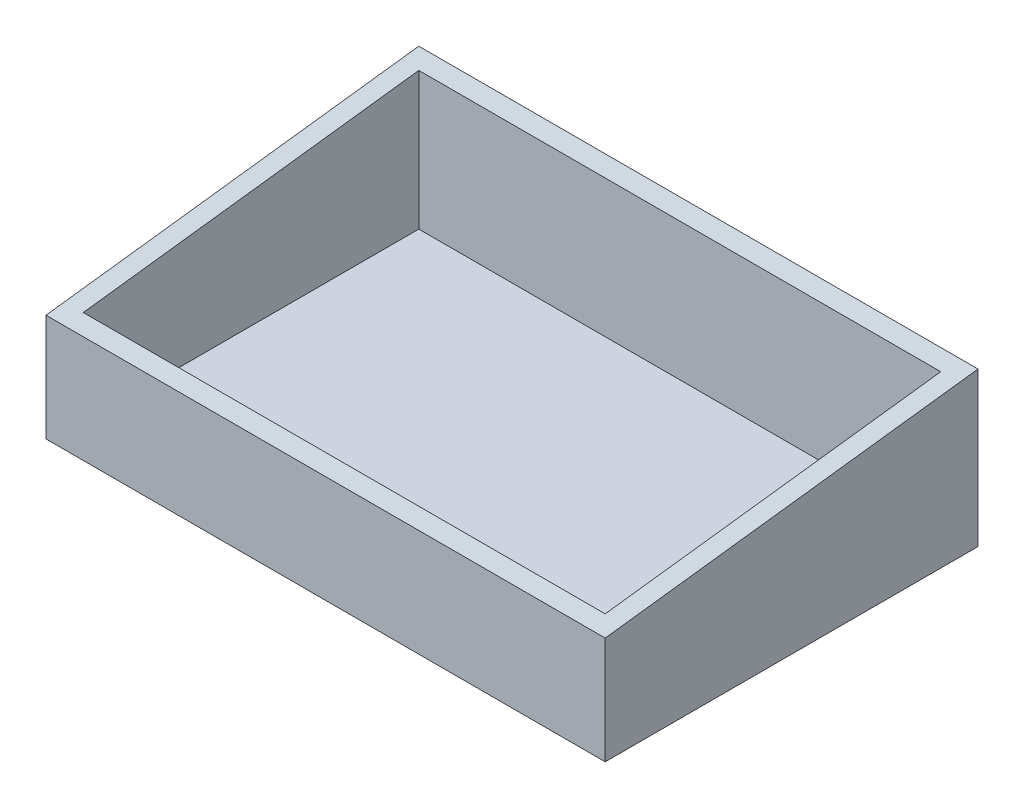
ISO-10303-21;
HEADER;
FILE_DESCRIPTION(('STEP AP214'),'2;1');
FILE_NAME('part.step','',(''),(''),'','','');
FILE_SCHEMA(('AUTOMOTIVE_DESIGN { 1 0 10303 214 1 1 1 1 }'));
ENDSEC;
DATA;
#1=APPLICATION_CONTEXT('core data for automotive mechanical design processes');
#2=APPLICATION_PROTOCOL_DEFINITION('international standard','automotive_design',2000,#1);
#3=PRODUCT_CONTEXT('',#1,'mechanical');
#4=PRODUCT('Part','Part','',(#3));
#5=PRODUCT_RELATED_PRODUCT_CATEGORY('part','',(#4));
#6=PRODUCT_DEFINITION_FORMATION('','',#4);
#7=PRODUCT_DEFINITION_CONTEXT('part definition',#1,'design');
#8=PRODUCT_DEFINITION('design','',#6,#7);
#9=PRODUCT_DEFINITION_SHAPE('','',#8);
#10=(LENGTH_UNIT() NAMED_UNIT(*) SI_UNIT(.MILLI.,.METRE.));
#11=(NAMED_UNIT(*) PLANE_ANGLE_UNIT() SI_UNIT($,.RADIAN.));
#12=(NAMED_UNIT(*) SI_UNIT($,.STERADIAN.) SOLID_ANGLE_UNIT());
#13=UNCERTAINTY_MEASURE_WITH_UNIT(LENGTH_MEASURE(1.E-05),#10,'distance_accuracy_value','');
#14=(GEOMETRIC_REPRESENTATION_CONTEXT(3) GLOBAL_UNCERTAINTY_ASSIGNED_CONTEXT((#13)) GLOBAL_UNIT_ASSIGNED_CONTEXT((#10,
#11,#12)) REPRESENTATION_CONTEXT('',''));
#15=CARTESIAN_POINT('',(0.,0.,0.));
#16=DIRECTION('',(0.,0.,1.));
#17=DIRECTION('',(1.,0.,0.));
#18=AXIS2_PLACEMENT_3D('',#15,#16,#17);
#19=CARTESIAN_POINT('',(-600.,0.,400.));
#20=DIRECTION('',(0.,0.,1.));
#21=DIRECTION('',(1.,0.,0.));
#22=AXIS2_PLACEMENT_3D('',#19,#20,#21);
#23=PLANE('',#22);
#24=DIRECTION('',(0.,-1.,0.));
#25=VECTOR('',#24,1.);
#26=CARTESIAN_POINT('',(0.,0.,400.));
#27=LINE('',#26,#25);
#28=CARTESIAN_POINT('',(0.,115.,400.));
#29=VERTEX_POINT('',#28);
#30=CARTESIAN_POINT('',(0.,0.,400.));
#31=VERTEX_POINT('',#30);
#32=EDGE_CURVE('E142',#29,#31,#27,.T.);
#33=ORIENTED_EDGE('',*,*,#32,.F.);
#34=DIRECTION('',(1.,0.,0.));
#35=VECTOR('',#34,1.);
#36=CARTESIAN_POINT('',(-2274.68322278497,115.,400.));
#37=LINE('',#36,#35);
#38=CARTESIAN_POINT('',(-600.,115.,400.));
#39=VERTEX_POINT('',#38);
#40=EDGE_CURVE('E54',#39,#29,#37,.T.);
#41=ORIENTED_EDGE('',*,*,#40,.F.);
#42=DIRECTION('',(0.,-1.,0.));
#43=VECTOR('',#42,1.);
#44=CARTESIAN_POINT('',(-600.,0.,400.));
#45=LINE('',#44,#43);
#46=CARTESIAN_POINT('',(-600.,0.,400.));
#47=VERTEX_POINT('',#46);
#48=EDGE_CURVE('E133',#39,#47,#45,.T.);
#49=ORIENTED_EDGE('',*,*,#48,.T.);
#50=DIRECTION('',(1.,0.,0.));
#51=VECTOR('',#50,1.);
#52=CARTESIAN_POINT('',(-600.,0.,400.));
#53=LINE('',#52,#51);
#54=EDGE_CURVE('E149',#47,#31,#53,.T.);
#55=ORIENTED_EDGE('',*,*,#54,.T.);
#56=EDGE_LOOP('',(#33,#41,#49,#55));
#57=FACE_BOUND('',#56,.T.);
#58=ADVANCED_FACE('F32',(#57),#23,.T.);
#59=CARTESIAN_POINT('',(-600.,165.,0.));
#60=DIRECTION('',(1.,0.,0.));
#61=DIRECTION('',(0.,0.,-1.));
#62=AXIS2_PLACEMENT_3D('',#59,#60,#61);
#63=PLANE('',#62);
#64=DIRECTION('',(0.,-0.124034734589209,0.992277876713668));
#65=VECTOR('',#64,1.);
#66=CARTESIAN_POINT('',(-600.,165.,0.));
#67=LINE('',#66,#65);
#68=CARTESIAN_POINT('',(-600.,165.,0.));
#69=VERTEX_POINT('',#68);
#70=EDGE_CURVE('E127',#69,#39,#67,.T.);
#71=ORIENTED_EDGE('',*,*,#70,.F.);
#72=DIRECTION('',(0.,1.,0.));
#73=VECTOR('',#72,1.);
#74=CARTESIAN_POINT('',(-600.,0.,0.));
#75=LINE('',#74,#73);
#76=CARTESIAN_POINT('',(-600.,0.,0.));
#77=VERTEX_POINT('',#76);
#78=EDGE_CURVE('E130',#77,#69,#75,.T.);
#79=ORIENTED_EDGE('',*,*,#78,.F.);
#80=DIRECTION('',(0.,0.,-1.));
#81=VECTOR('',#80,1.);
#82=CARTESIAN_POINT('',(-600.,0.,0.));
#83=LINE('',#82,#81);
#84=EDGE_CURVE('E136',#47,#77,#83,.T.);
#85=ORIENTED_EDGE('',*,*,#84,.F.);
#86=ORIENTED_EDGE('',*,*,#48,.F.);
#87=EDGE_LOOP('',(#71,#79,#85,#86));
#88=FACE_BOUND('',#87,.T.);
#89=ADVANCED_FACE('F175',(#88),#63,.F.);
#90=CARTESIAN_POINT('',(0.,165.,0.));
#91=DIRECTION('',(1.,0.,0.));
#92=DIRECTION('',(0.,0.,-1.));
#93=AXIS2_PLACEMENT_3D('',#90,#91,#92);
#94=PLANE('',#93);
#95=DIRECTION('',(0.,1.,0.));
#96=VECTOR('',#95,1.);
#97=CARTESIAN_POINT('',(0.,0.,0.));
#98=LINE('',#97,#96);
#99=CARTESIAN_POINT('',(0.,0.,0.));
#100=VERTEX_POINT('',#99);
#101=CARTESIAN_POINT('',(0.,165.,0.));
#102=VERTEX_POINT('',#101);
#103=EDGE_CURVE('E129',#100,#102,#98,.T.);
#104=ORIENTED_EDGE('',*,*,#103,.T.);
#105=DIRECTION('',(0.,-0.124034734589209,0.992277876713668));
#106=VECTOR('',#105,1.);
#107=CARTESIAN_POINT('',(0.,165.,0.));
#108=LINE('',#107,#106);
#109=EDGE_CURVE('E148',#102,#29,#108,.T.);
#110=ORIENTED_EDGE('',*,*,#109,.T.);
#111=ORIENTED_EDGE('',*,*,#32,.T.);
#112=DIRECTION('',(0.,0.,-1.));
#113=VECTOR('',#112,1.);
#114=CARTESIAN_POINT('',(0.,0.,0.));
#115=LINE('',#114,#113);
#116=EDGE_CURVE('E134',#31,#100,#115,.T.);
#117=ORIENTED_EDGE('',*,*,#116,.T.);
#118=EDGE_LOOP('',(#104,#110,#111,#117));
#119=FACE_BOUND('',#118,.T.);
#120=ADVANCED_FACE('F180',(#119),#94,.T.);
#121=CARTESIAN_POINT('',(-600.,0.,0.));
#122=DIRECTION('',(0.,0.,-1.));
#123=DIRECTION('',(-1.,0.,0.));
#124=AXIS2_PLACEMENT_3D('',#121,#122,#123);
#125=PLANE('',#124);
#126=ORIENTED_EDGE('',*,*,#103,.F.);
#127=DIRECTION('',(1.,0.,0.));
#128=VECTOR('',#127,1.);
#129=CARTESIAN_POINT('',(-600.,0.,0.));
#130=LINE('',#129,#128);
#131=EDGE_CURVE('E146',#77,#100,#130,.T.);
#132=ORIENTED_EDGE('',*,*,#131,.F.);
#133=ORIENTED_EDGE('',*,*,#78,.T.);
#134=DIRECTION('',(1.,0.,0.));
#135=VECTOR('',#134,1.);
#136=CARTESIAN_POINT('',(-600.,165.,0.));
#137=LINE('',#136,#135);
#138=EDGE_CURVE('E139',#69,#102,#137,.T.);
#139=ORIENTED_EDGE('',*,*,#138,.T.);
#140=EDGE_LOOP('',(#126,#132,#133,#139));
#141=FACE_BOUND('',#140,.T.);
#142=ADVANCED_FACE('F34',(#141),#125,.T.);
#143=CARTESIAN_POINT('',(-600.,0.,0.));
#144=DIRECTION('',(0.,-1.,0.));
#145=DIRECTION('',(0.,0.,-1.));
#146=AXIS2_PLACEMENT_3D('',#143,#144,#145);
#147=PLANE('',#146);
#148=ORIENTED_EDGE('',*,*,#116,.F.);
#149=ORIENTED_EDGE('',*,*,#54,.F.);
#150=ORIENTED_EDGE('',*,*,#84,.T.);
#151=ORIENTED_EDGE('',*,*,#131,.T.);
#152=EDGE_LOOP('',(#148,#149,#150,#151));
#153=FACE_BOUND('',#152,.T.);
#154=ADVANCED_FACE('F185',(#153),#147,.T.);
#155=CARTESIAN_POINT('',(-2274.68322278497,165.,0.));
#156=DIRECTION('',(0.,0.992277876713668,0.124034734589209));
#157=DIRECTION('',(0.,-0.124034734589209,0.992277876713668));
#158=AXIS2_PLACEMENT_3D('',#155,#156,#157);
#159=PLANE('',#158);
#160=DIRECTION('',(0.,-0.124034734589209,0.992277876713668));
#161=VECTOR('',#160,1.);
#162=CARTESIAN_POINT('',(-580.,165.,0.));
#163=LINE('',#162,#161);
#164=CARTESIAN_POINT('',(-580.,162.5,20.));
#165=VERTEX_POINT('',#164);
#166=CARTESIAN_POINT('',(-580.,117.5,380.));
#167=VERTEX_POINT('',#166);
#168=EDGE_CURVE('E11',#165,#167,#163,.T.);
#169=ORIENTED_EDGE('',*,*,#168,.F.);
#170=DIRECTION('',(-1.,0.,0.));
#171=VECTOR('',#170,1.);
#172=CARTESIAN_POINT('',(-2274.68322278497,162.5,20.));
#173=LINE('',#172,#171);
#174=CARTESIAN_POINT('',(-20.,162.5,20.));
#175=VERTEX_POINT('',#174);
#176=EDGE_CURVE('E40',#175,#165,#173,.T.);
#177=ORIENTED_EDGE('',*,*,#176,.F.);
#178=DIRECTION('',(0.,0.124034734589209,-0.992277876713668));
#179=VECTOR('',#178,1.);
#180=CARTESIAN_POINT('',(-20.,165.,-3.85107881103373E-13));
#181=LINE('',#180,#179);
#182=CARTESIAN_POINT('',(-20.,117.5,380.));
#183=VERTEX_POINT('',#182);
#184=EDGE_CURVE('E157',#183,#175,#181,.T.);
#185=ORIENTED_EDGE('',*,*,#184,.F.);
#186=DIRECTION('',(1.,0.,0.));
#187=VECTOR('',#186,1.);
#188=CARTESIAN_POINT('',(-2274.68322278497,117.5,380.));
#189=LINE('',#188,#187);
#190=EDGE_CURVE('E155',#167,#183,#189,.T.);
#191=ORIENTED_EDGE('',*,*,#190,.F.);
#192=EDGE_LOOP('',(#169,#177,#185,#191));
#193=FACE_BOUND('',#192,.T.);
#194=ORIENTED_EDGE('',*,*,#138,.F.);
#195=ORIENTED_EDGE('',*,*,#70,.T.);
#196=ORIENTED_EDGE('',*,*,#40,.T.);
#197=ORIENTED_EDGE('',*,*,#109,.F.);
#198=EDGE_LOOP('',(#194,#195,#196,#197));
#199=FACE_BOUND('',#198,.T.);
#200=ADVANCED_FACE('F163',(#193,#199),#159,.T.);
#201=CARTESIAN_POINT('',(-580.,15.,20.));
#202=DIRECTION('',(-1.,0.,0.));
#203=DIRECTION('',(0.,0.,1.));
#204=AXIS2_PLACEMENT_3D('',#201,#202,#203);
#205=PLANE('',#204);
#206=ORIENTED_EDGE('',*,*,#168,.T.);
#207=DIRECTION('',(0.,1.,0.));
#208=VECTOR('',#207,1.);
#209=CARTESIAN_POINT('',(-580.,15.,380.));
#210=LINE('',#209,#208);
#211=CARTESIAN_POINT('',(-580.,15.,380.));
#212=VERTEX_POINT('',#211);
#213=EDGE_CURVE('E47',#212,#167,#210,.T.);
#214=ORIENTED_EDGE('',*,*,#213,.F.);
#215=DIRECTION('',(0.,0.,1.));
#216=VECTOR('',#215,1.);
#217=CARTESIAN_POINT('',(-580.,15.,20.));
#218=LINE('',#217,#216);
#219=CARTESIAN_POINT('',(-580.,15.,20.));
#220=VERTEX_POINT('',#219);
#221=EDGE_CURVE('E98',#220,#212,#218,.T.);
#222=ORIENTED_EDGE('',*,*,#221,.F.);
#223=DIRECTION('',(0.,1.,0.));
#224=VECTOR('',#223,1.);
#225=CARTESIAN_POINT('',(-580.,15.,20.));
#226=LINE('',#225,#224);
#227=EDGE_CURVE('E120',#220,#165,#226,.T.);
#228=ORIENTED_EDGE('',*,*,#227,.T.);
#229=EDGE_LOOP('',(#206,#214,#222,#228));
#230=FACE_BOUND('',#229,.T.);
#231=ADVANCED_FACE('F95',(#230),#205,.F.);
#232=CARTESIAN_POINT('',(-580.,15.,20.));
#233=DIRECTION('',(0.,0.,-1.));
#234=DIRECTION('',(0.,1.,0.));
#235=AXIS2_PLACEMENT_3D('',#232,#233,#234);
#236=PLANE('',#235);
#237=ORIENTED_EDGE('',*,*,#176,.T.);
#238=ORIENTED_EDGE('',*,*,#227,.F.);
#239=DIRECTION('',(-1.,0.,0.));
#240=VECTOR('',#239,1.);
#241=CARTESIAN_POINT('',(-580.,15.,20.));
#242=LINE('',#241,#240);
#243=CARTESIAN_POINT('',(-20.,15.,20.));
#244=VERTEX_POINT('',#243);
#245=EDGE_CURVE('E103',#244,#220,#242,.T.);
#246=ORIENTED_EDGE('',*,*,#245,.F.);
#247=DIRECTION('',(0.,1.,0.));
#248=VECTOR('',#247,1.);
#249=CARTESIAN_POINT('',(-20.,15.,20.));
#250=LINE('',#249,#248);
#251=EDGE_CURVE('E122',#244,#175,#250,.T.);
#252=ORIENTED_EDGE('',*,*,#251,.T.);
#253=EDGE_LOOP('',(#237,#238,#246,#252));
#254=FACE_BOUND('',#253,.T.);
#255=ADVANCED_FACE('F160',(#254),#236,.F.);
#256=CARTESIAN_POINT('',(-20.,15.,20.));
#257=DIRECTION('',(1.,0.,0.));
#258=DIRECTION('',(0.,0.,-1.));
#259=AXIS2_PLACEMENT_3D('',#256,#257,#258);
#260=PLANE('',#259);
#261=ORIENTED_EDGE('',*,*,#184,.T.);
#262=ORIENTED_EDGE('',*,*,#251,.F.);
#263=DIRECTION('',(0.,0.,-1.));
#264=VECTOR('',#263,1.);
#265=CARTESIAN_POINT('',(-20.,15.,20.));
#266=LINE('',#265,#264);
#267=CARTESIAN_POINT('',(-20.,15.,380.));
#268=VERTEX_POINT('',#267);
#269=EDGE_CURVE('E112',#268,#244,#266,.T.);
#270=ORIENTED_EDGE('',*,*,#269,.F.);
#271=DIRECTION('',(0.,1.,0.));
#272=VECTOR('',#271,1.);
#273=CARTESIAN_POINT('',(-20.,15.,380.));
#274=LINE('',#273,#272);
#275=EDGE_CURVE('E102',#268,#183,#274,.T.);
#276=ORIENTED_EDGE('',*,*,#275,.T.);
#277=EDGE_LOOP('',(#261,#262,#270,#276));
#278=FACE_BOUND('',#277,.T.);
#279=ADVANCED_FACE('F165',(#278),#260,.F.);
#280=CARTESIAN_POINT('',(-580.,15.,380.));
#281=DIRECTION('',(0.,0.,1.));
#282=DIRECTION('',(0.,-1.,0.));
#283=AXIS2_PLACEMENT_3D('',#280,#281,#282);
#284=PLANE('',#283);
#285=ORIENTED_EDGE('',*,*,#190,.T.);
#286=ORIENTED_EDGE('',*,*,#275,.F.);
#287=DIRECTION('',(1.,0.,0.));
#288=VECTOR('',#287,1.);
#289=CARTESIAN_POINT('',(-580.,15.,380.));
#290=LINE('',#289,#288);
#291=EDGE_CURVE('E106',#212,#268,#290,.T.);
#292=ORIENTED_EDGE('',*,*,#291,.F.);
#293=ORIENTED_EDGE('',*,*,#213,.T.);
#294=EDGE_LOOP('',(#285,#286,#292,#293));
#295=FACE_BOUND('',#294,.T.);
#296=ADVANCED_FACE('F107',(#295),#284,.F.);
#297=CARTESIAN_POINT('',(-580.,15.,380.));
#298=DIRECTION('',(0.,1.,0.));
#299=DIRECTION('',(0.,0.,1.));
#300=AXIS2_PLACEMENT_3D('',#297,#298,#299);
#301=PLANE('',#300);
#302=ORIENTED_EDGE('',*,*,#221,.T.);
#303=ORIENTED_EDGE('',*,*,#291,.T.);
#304=ORIENTED_EDGE('',*,*,#269,.T.);
#305=ORIENTED_EDGE('',*,*,#245,.T.);
#306=EDGE_LOOP('',(#302,#303,#304,#305));
#307=FACE_BOUND('',#306,.T.);
#308=ADVANCED_FACE('F114',(#307),#301,.T.);
#309=CLOSED_SHELL('',(#58,#89,#120,#142,#154,#200,#231,#255,#279,#296,#308));
#310=MANIFOLD_SOLID_BREP('B2',#309);
#311=ADVANCED_BREP_SHAPE_REPRESENTATION('',(#18,#310),#14);
#312=SHAPE_DEFINITION_REPRESENTATION(#9,#311);
ENDSEC;
END-ISO-10303-21;
